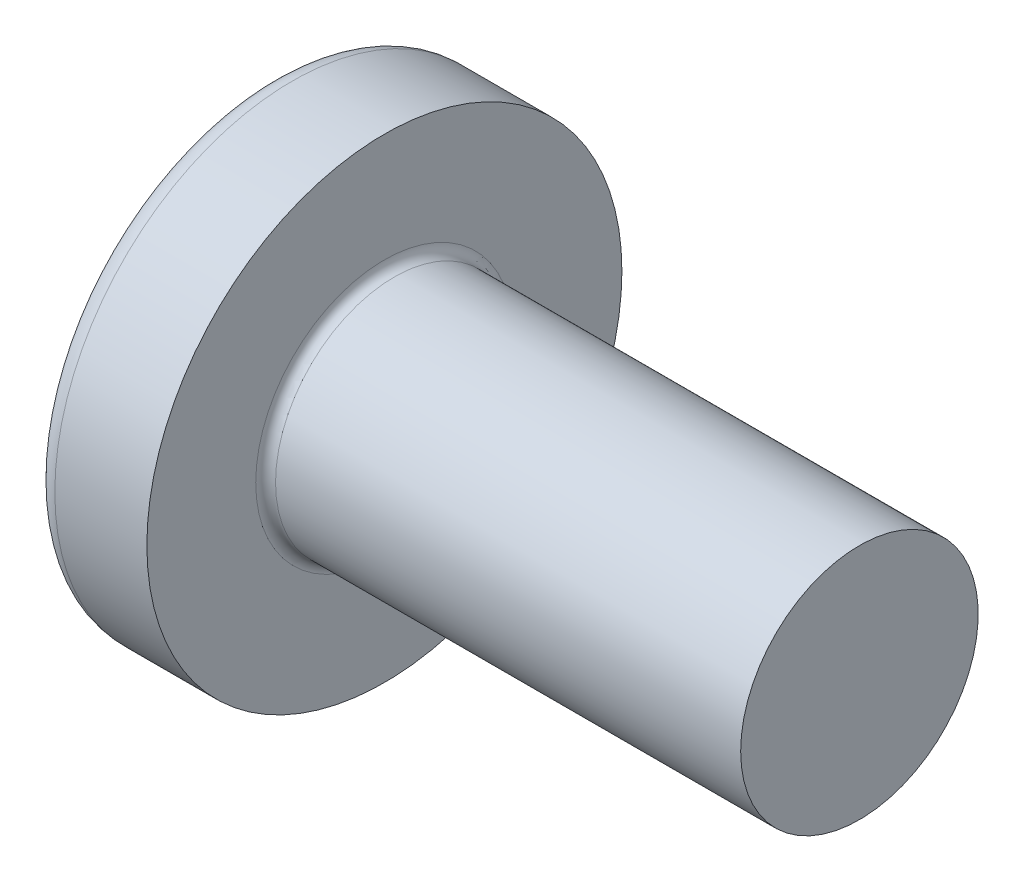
from build123d import *

# Parameters (mm, degrees)
FILLET1_R    = 0.25
RECPAT_COUNT = 2
RECPAT_ANGLE = 90


with BuildPart() as part:
    # BodySke → Base-Revolve (revolve)
    with BuildSketch(Plane.XY, mode=Mode.PRIVATE) as base_revolve_sk:
        with BuildLine():
            Line((4.6, 3), (4.6, 6))
            Line((4.6, 6), (2.274716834, 6))
            ThreePointArc((2.274716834, 6), (2.026424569, 5.939532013), (1.833738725, 5.77167019))
            ThreePointArc((1.833738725, 5.77167019), (0.469454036, 3.027985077), (0, 0))
            Line((0, 0), (16.6, 0))
            Line((16.6, 0), (16.6, 3))
            Line((16.6, 3), (4.6, 3))
        make_face()
    revolve(base_revolve_sk.sketch.rotate(Axis((2.274716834, 0, 0), (1, 0, 0)), 90), axis=Axis((2.274716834, 0, 0), (1, 0, 0)))

    # Fillet1
    fillet1_edges = [part.edges().sort_by_distance(p)[0] for p in [
        (4.6, 0, -3),
    ]]
    fillet(fillet1_edges, radius=FILLET1_R)

    # Sketch3 → Recess section 0
    with BuildSketch(Plane(origin=(0, 0, 0), x_dir=(0, 0, -1), z_dir=(1, 0, 0))):
        with BuildLine():
            Line((0.71, -3.35), (-0.71, -3.35))
            Line((-0.71, -3.35), (-0.71, 3.35))
            Line((-0.71, 3.35), (0.71, 3.35))
            Line((0.71, 3.35), (0.71, -3.35))
        make_face()
    # Sketch4 → Recess section 1
    with BuildSketch(Plane(origin=(3.46, 0, 0), x_dir=(0, 0, -1), z_dir=(1, 0, 0))):
        with BuildLine():
            Line((0.71, -1.624907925), (-0.71, -1.624907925))
            Line((-0.71, -1.624907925), (-0.71, 1.624907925))
            Line((-0.71, 1.624907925), (0.71, 1.624907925))
            Line((0.71, 1.624907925), (0.71, -1.624907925))
        make_face()
    recess = loft(mode=Mode.SUBTRACT)

    # RecPat: Recess ×2 about axis
    recpat_axis = Axis((0, 0, 0), (1, 0, 0))
    for i in range(1, RECPAT_COUNT):
        add(recess.rotate(recpat_axis, i * RECPAT_ANGLE / (RECPAT_COUNT - 1)), mode=Mode.SUBTRACT)

    # RecCorSke → RecessCore (revolve, cut)
    with BuildSketch(Plane.XY, mode=Mode.PRIVATE) as recesscore_sk:
        Polygon((0, 0), (0, 1.522446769), (3.46, 1.2805), (3.876059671, 0), align=None)
    revolve(recesscore_sk.sketch.rotate(Axis((-3.175, 0, 0), (1, 0, 0)), 12.930791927), axis=Axis((-3.175, 0, 0), (1, 0, 0)), mode=Mode.SUBTRACT)


solid = part.part
